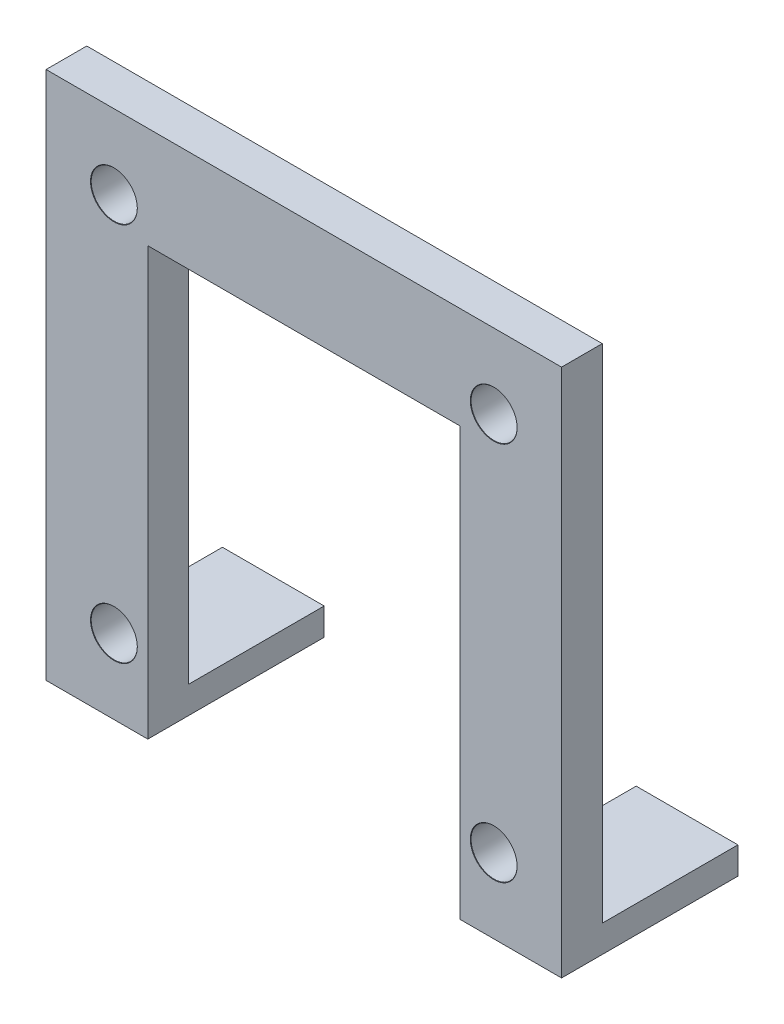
from build123d import *

# Parameters (mm, degrees)
BOSS_EXTRUDE1_DEPTH            = 3
M3_CLEARANCE_HOLE1_D           = 3.4
M3_CLEARANCE_HOLE1_CSINK_D     = 3.45
M3_CLEARANCE_HOLE1_CSINK_ANGLE = 90
SKETCH14_W                     = 7.5
SKETCH14_H                     = 2
BOSS_EXTRUDE3_DEPTH            = 10


with BuildPart() as part:
    # Sketch2 → Boss-Extrude1 (new body)
    with BuildSketch(Plane.XY):
        Polygon((0, 0), (0, 39), (38, 39), (38, 0), (30.5, 0), (30.5, 31.5), (7.5, 31.5), (7.5, 0), align=None)
    extrude(amount=BOSS_EXTRUDE1_DEPTH)

    # M3 Clearance Hole1 (through all)
    with Locations(Plane.XY.offset(3)):
        with Locations((5, 5.5), (19, 19.5), (5, 33.5), (33, 5.5), (33, 33.5)):
            CounterSinkHole(M3_CLEARANCE_HOLE1_D / 2, M3_CLEARANCE_HOLE1_CSINK_D / 2, counter_sink_angle=M3_CLEARANCE_HOLE1_CSINK_ANGLE)

    # Sketch14 → Boss-Extrude3 (add)
    with BuildSketch(Plane(origin=(0, 0, 0), x_dir=(-1, 0, 0), z_dir=(0, 0, -1))):
        with Locations((-34.25, 1)):
            Rectangle(SKETCH14_W, SKETCH14_H)
        with Locations((-3.75, 1)):
            Rectangle(SKETCH14_W, SKETCH14_H)
    extrude(amount=BOSS_EXTRUDE3_DEPTH)


solid = part.part
